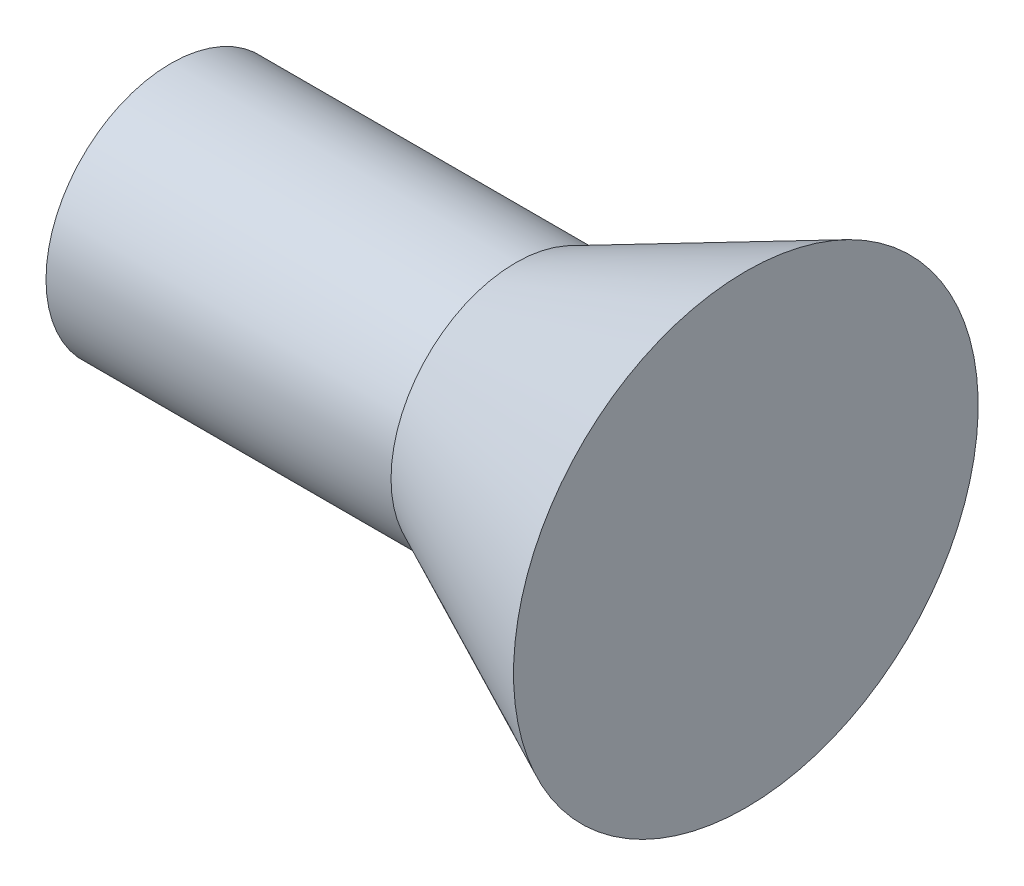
from build123d import *


with BuildPart() as part:
    # Sketch1 → Revolve1 (revolve)
    with BuildSketch(Plane.XY):
        Polygon((0, 0), (0, 5.425), (15, 5.425), (25, 10.1), (25, 0), align=None)
    revolve(axis=Axis((25, 0, 0), (-1, 0, 0)))


solid = part.part
